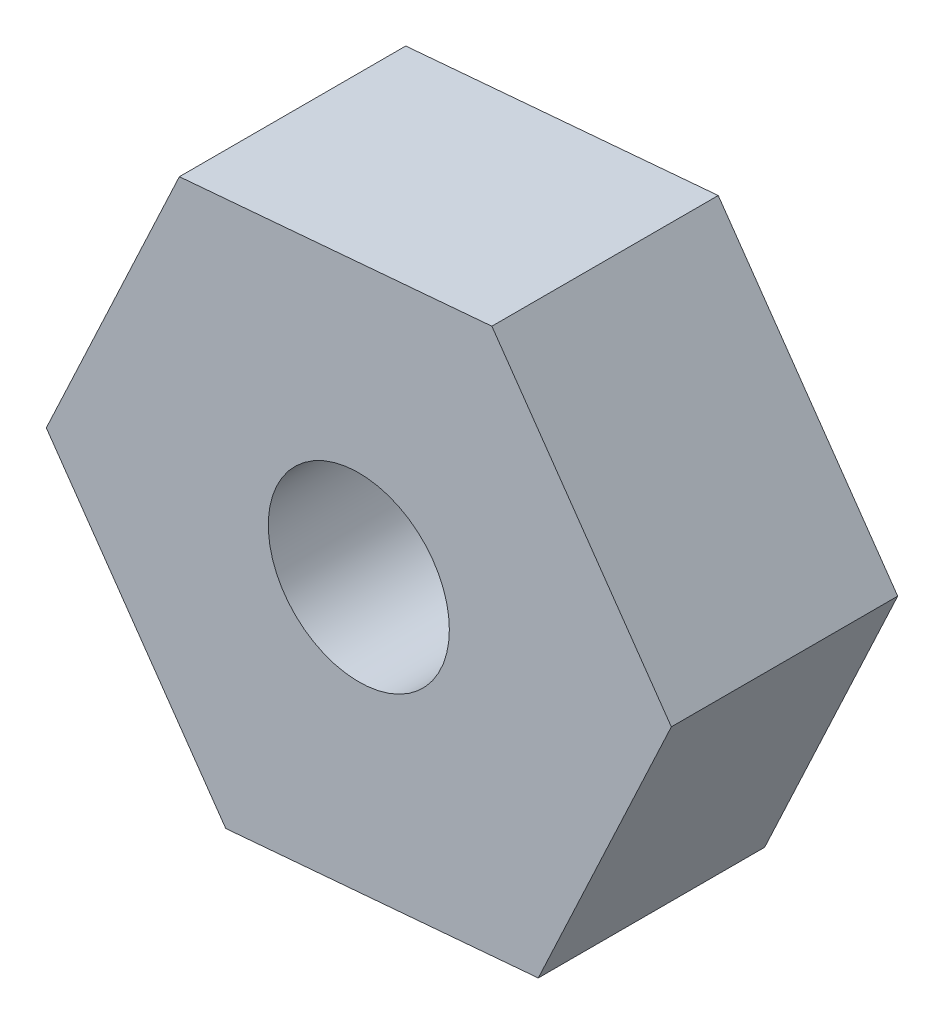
ISO-10303-21;
HEADER;
FILE_DESCRIPTION(('STEP AP214'),'2;1');
FILE_NAME('part.step','',(''),(''),'','','');
FILE_SCHEMA(('AUTOMOTIVE_DESIGN { 1 0 10303 214 1 1 1 1 }'));
ENDSEC;
DATA;
#1=APPLICATION_CONTEXT('core data for automotive mechanical design processes');
#2=APPLICATION_PROTOCOL_DEFINITION('international standard','automotive_design',2000,#1);
#3=PRODUCT_CONTEXT('',#1,'mechanical');
#4=PRODUCT('Part','Part','',(#3));
#5=PRODUCT_RELATED_PRODUCT_CATEGORY('part','',(#4));
#6=PRODUCT_DEFINITION_FORMATION('','',#4);
#7=PRODUCT_DEFINITION_CONTEXT('part definition',#1,'design');
#8=PRODUCT_DEFINITION('design','',#6,#7);
#9=PRODUCT_DEFINITION_SHAPE('','',#8);
#10=(LENGTH_UNIT() NAMED_UNIT(*) SI_UNIT(.MILLI.,.METRE.));
#11=(NAMED_UNIT(*) PLANE_ANGLE_UNIT() SI_UNIT($,.RADIAN.));
#12=(NAMED_UNIT(*) SI_UNIT($,.STERADIAN.) SOLID_ANGLE_UNIT());
#13=UNCERTAINTY_MEASURE_WITH_UNIT(LENGTH_MEASURE(1.E-05),#10,'distance_accuracy_value','');
#14=(GEOMETRIC_REPRESENTATION_CONTEXT(3) GLOBAL_UNCERTAINTY_ASSIGNED_CONTEXT((#13)) GLOBAL_UNIT_ASSIGNED_CONTEXT((#10,
#11,#12)) REPRESENTATION_CONTEXT('',''));
#15=CARTESIAN_POINT('',(0.,0.,0.));
#16=DIRECTION('',(0.,0.,1.));
#17=DIRECTION('',(1.,0.,0.));
#18=AXIS2_PLACEMENT_3D('',#15,#16,#17);
#19=CARTESIAN_POINT('',(0.,0.,6.35));
#20=DIRECTION('',(0.,0.,1.));
#21=DIRECTION('',(1.,0.,0.));
#22=AXIS2_PLACEMENT_3D('',#19,#20,#21);
#23=PLANE('',#22);
#24=DIRECTION('',(0.996346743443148,0.0854000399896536,0.));
#25=VECTOR('',#24,1.);
#26=CARTESIAN_POINT('',(-3.73258857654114,-7.96787189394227,6.35));
#27=LINE('',#26,#25);
#28=CARTESIAN_POINT('',(-3.73258857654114,-7.96787189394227,6.35));
#29=VERTEX_POINT('',#28);
#30=CARTESIAN_POINT('',(5.03408518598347,-7.21645247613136,6.35));
#31=VERTEX_POINT('',#30);
#32=EDGE_CURVE('E129',#29,#31,#27,.T.);
#33=ORIENTED_EDGE('',*,*,#32,.T.);
#34=DIRECTION('',(0.424214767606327,0.905561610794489,0.));
#35=VECTOR('',#34,1.);
#36=CARTESIAN_POINT('',(5.03408518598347,-7.21645247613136,6.35));
#37=LINE('',#36,#35);
#38=CARTESIAN_POINT('',(8.7666737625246,0.751419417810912,6.35));
#39=VERTEX_POINT('',#38);
#40=EDGE_CURVE('E87',#31,#39,#37,.T.);
#41=ORIENTED_EDGE('',*,*,#40,.T.);
#42=DIRECTION('',(-0.572131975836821,0.820161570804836,0.));
#43=VECTOR('',#42,1.);
#44=CARTESIAN_POINT('',(8.7666737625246,0.751419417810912,6.35));
#45=LINE('',#44,#43);
#46=CARTESIAN_POINT('',(3.73258857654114,7.96787189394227,6.35));
#47=VERTEX_POINT('',#46);
#48=EDGE_CURVE('E100',#39,#47,#45,.T.);
#49=ORIENTED_EDGE('',*,*,#48,.T.);
#50=DIRECTION('',(-0.996346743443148,-0.0854000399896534,0.));
#51=VECTOR('',#50,1.);
#52=CARTESIAN_POINT('',(3.73258857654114,7.96787189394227,6.35));
#53=LINE('',#52,#51);
#54=CARTESIAN_POINT('',(-5.03408518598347,7.21645247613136,6.35));
#55=VERTEX_POINT('',#54);
#56=EDGE_CURVE('E94',#47,#55,#53,.T.);
#57=ORIENTED_EDGE('',*,*,#56,.T.);
#58=DIRECTION('',(-0.424214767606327,-0.905561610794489,0.));
#59=VECTOR('',#58,1.);
#60=CARTESIAN_POINT('',(-5.03408518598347,7.21645247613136,6.35));
#61=LINE('',#60,#59);
#62=CARTESIAN_POINT('',(-8.7666737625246,-0.751419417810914,6.35));
#63=VERTEX_POINT('',#62);
#64=EDGE_CURVE('E98',#55,#63,#61,.T.);
#65=ORIENTED_EDGE('',*,*,#64,.T.);
#66=DIRECTION('',(0.572131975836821,-0.820161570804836,0.));
#67=VECTOR('',#66,1.);
#68=CARTESIAN_POINT('',(-8.7666737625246,-0.751419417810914,6.35));
#69=LINE('',#68,#67);
#70=EDGE_CURVE('E50',#63,#29,#69,.T.);
#71=ORIENTED_EDGE('',*,*,#70,.T.);
#72=EDGE_LOOP('',(#33,#41,#49,#57,#65,#71));
#73=FACE_BOUND('',#72,.T.);
#74=CARTESIAN_POINT('',(0.,0.,6.35));
#75=DIRECTION('',(0.,0.,1.));
#76=DIRECTION('',(1.,0.,0.));
#77=AXIS2_PLACEMENT_3D('',#74,#75,#76);
#78=CIRCLE('',#77,2.54);
#79=CARTESIAN_POINT('',(2.54,0.,6.35));
#80=VERTEX_POINT('',#79);
#81=EDGE_CURVE('E122',#80,#80,#78,.T.);
#82=ORIENTED_EDGE('',*,*,#81,.F.);
#83=EDGE_LOOP('',(#82));
#84=FACE_BOUND('',#83,.T.);
#85=ADVANCED_FACE('F33',(#73,#84),#23,.T.);
#86=CARTESIAN_POINT('',(0.,0.,0.));
#87=DIRECTION('',(0.,0.,1.));
#88=DIRECTION('',(1.,0.,0.));
#89=AXIS2_PLACEMENT_3D('',#86,#87,#88);
#90=PLANE('',#89);
#91=DIRECTION('',(0.996346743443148,0.0854000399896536,0.));
#92=VECTOR('',#91,1.);
#93=CARTESIAN_POINT('',(-3.73258857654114,-7.96787189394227,0.));
#94=LINE('',#93,#92);
#95=CARTESIAN_POINT('',(-3.73258857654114,-7.96787189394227,0.));
#96=VERTEX_POINT('',#95);
#97=CARTESIAN_POINT('',(5.03408518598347,-7.21645247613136,0.));
#98=VERTEX_POINT('',#97);
#99=EDGE_CURVE('E118',#96,#98,#94,.T.);
#100=ORIENTED_EDGE('',*,*,#99,.F.);
#101=DIRECTION('',(0.572131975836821,-0.820161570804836,0.));
#102=VECTOR('',#101,1.);
#103=CARTESIAN_POINT('',(-8.7666737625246,-0.751419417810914,0.));
#104=LINE('',#103,#102);
#105=CARTESIAN_POINT('',(-8.7666737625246,-0.751419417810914,0.));
#106=VERTEX_POINT('',#105);
#107=EDGE_CURVE('E79',#106,#96,#104,.T.);
#108=ORIENTED_EDGE('',*,*,#107,.F.);
#109=DIRECTION('',(-0.424214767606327,-0.905561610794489,0.));
#110=VECTOR('',#109,1.);
#111=CARTESIAN_POINT('',(-5.03408518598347,7.21645247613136,0.));
#112=LINE('',#111,#110);
#113=CARTESIAN_POINT('',(-5.03408518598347,7.21645247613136,0.));
#114=VERTEX_POINT('',#113);
#115=EDGE_CURVE('E73',#114,#106,#112,.T.);
#116=ORIENTED_EDGE('',*,*,#115,.F.);
#117=DIRECTION('',(-0.996346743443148,-0.0854000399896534,0.));
#118=VECTOR('',#117,1.);
#119=CARTESIAN_POINT('',(3.73258857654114,7.96787189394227,0.));
#120=LINE('',#119,#118);
#121=CARTESIAN_POINT('',(3.73258857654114,7.96787189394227,0.));
#122=VERTEX_POINT('',#121);
#123=EDGE_CURVE('E108',#122,#114,#120,.T.);
#124=ORIENTED_EDGE('',*,*,#123,.F.);
#125=DIRECTION('',(-0.572131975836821,0.820161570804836,0.));
#126=VECTOR('',#125,1.);
#127=CARTESIAN_POINT('',(8.7666737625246,0.751419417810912,0.));
#128=LINE('',#127,#126);
#129=CARTESIAN_POINT('',(8.7666737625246,0.751419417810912,0.));
#130=VERTEX_POINT('',#129);
#131=EDGE_CURVE('E124',#130,#122,#128,.T.);
#132=ORIENTED_EDGE('',*,*,#131,.F.);
#133=DIRECTION('',(0.424214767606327,0.905561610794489,0.));
#134=VECTOR('',#133,1.);
#135=CARTESIAN_POINT('',(5.03408518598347,-7.21645247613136,0.));
#136=LINE('',#135,#134);
#137=EDGE_CURVE('E121',#98,#130,#136,.T.);
#138=ORIENTED_EDGE('',*,*,#137,.F.);
#139=EDGE_LOOP('',(#100,#108,#116,#124,#132,#138));
#140=FACE_BOUND('',#139,.T.);
#141=CARTESIAN_POINT('',(0.,0.,0.));
#142=DIRECTION('',(0.,0.,1.));
#143=DIRECTION('',(1.,0.,0.));
#144=AXIS2_PLACEMENT_3D('',#141,#142,#143);
#145=CIRCLE('',#144,2.54);
#146=CARTESIAN_POINT('',(2.54,0.,0.));
#147=VERTEX_POINT('',#146);
#148=EDGE_CURVE('E222',#147,#147,#145,.T.);
#149=ORIENTED_EDGE('',*,*,#148,.T.);
#150=EDGE_LOOP('',(#149));
#151=FACE_BOUND('',#150,.T.);
#152=ADVANCED_FACE('F138',(#140,#151),#90,.F.);
#153=CARTESIAN_POINT('',(-3.73258857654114,-7.96787189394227,6.35));
#154=DIRECTION('',(-0.0854000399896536,0.996346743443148,0.));
#155=DIRECTION('',(-0.996346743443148,-0.0854000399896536,0.));
#156=AXIS2_PLACEMENT_3D('',#153,#154,#155);
#157=PLANE('',#156);
#158=ORIENTED_EDGE('',*,*,#99,.T.);
#159=DIRECTION('',(0.,0.,-1.));
#160=VECTOR('',#159,1.);
#161=CARTESIAN_POINT('',(5.03408518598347,-7.21645247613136,6.35));
#162=LINE('',#161,#160);
#163=EDGE_CURVE('E11',#31,#98,#162,.T.);
#164=ORIENTED_EDGE('',*,*,#163,.F.);
#165=ORIENTED_EDGE('',*,*,#32,.F.);
#166=DIRECTION('',(0.,0.,-1.));
#167=VECTOR('',#166,1.);
#168=CARTESIAN_POINT('',(-3.73258857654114,-7.96787189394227,6.35));
#169=LINE('',#168,#167);
#170=EDGE_CURVE('E114',#29,#96,#169,.T.);
#171=ORIENTED_EDGE('',*,*,#170,.T.);
#172=EDGE_LOOP('',(#158,#164,#165,#171));
#173=FACE_BOUND('',#172,.T.);
#174=ADVANCED_FACE('F35',(#173),#157,.F.);
#175=CARTESIAN_POINT('',(5.03408518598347,-7.21645247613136,6.35));
#176=DIRECTION('',(-0.905561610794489,0.424214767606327,0.));
#177=DIRECTION('',(-0.424214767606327,-0.905561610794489,0.));
#178=AXIS2_PLACEMENT_3D('',#175,#176,#177);
#179=PLANE('',#178);
#180=ORIENTED_EDGE('',*,*,#137,.T.);
#181=DIRECTION('',(0.,0.,-1.));
#182=VECTOR('',#181,1.);
#183=CARTESIAN_POINT('',(8.7666737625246,0.751419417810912,6.35));
#184=LINE('',#183,#182);
#185=EDGE_CURVE('E42',#39,#130,#184,.T.);
#186=ORIENTED_EDGE('',*,*,#185,.F.);
#187=ORIENTED_EDGE('',*,*,#40,.F.);
#188=ORIENTED_EDGE('',*,*,#163,.T.);
#189=EDGE_LOOP('',(#180,#186,#187,#188));
#190=FACE_BOUND('',#189,.T.);
#191=ADVANCED_FACE('F163',(#190),#179,.F.);
#192=CARTESIAN_POINT('',(8.7666737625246,0.751419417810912,6.35));
#193=DIRECTION('',(-0.820161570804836,-0.572131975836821,0.));
#194=DIRECTION('',(0.572131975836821,-0.820161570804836,0.));
#195=AXIS2_PLACEMENT_3D('',#192,#193,#194);
#196=PLANE('',#195);
#197=ORIENTED_EDGE('',*,*,#131,.T.);
#198=DIRECTION('',(0.,0.,-1.));
#199=VECTOR('',#198,1.);
#200=CARTESIAN_POINT('',(3.73258857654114,7.96787189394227,6.35));
#201=LINE('',#200,#199);
#202=EDGE_CURVE('E109',#47,#122,#201,.T.);
#203=ORIENTED_EDGE('',*,*,#202,.F.);
#204=ORIENTED_EDGE('',*,*,#48,.F.);
#205=ORIENTED_EDGE('',*,*,#185,.T.);
#206=EDGE_LOOP('',(#197,#203,#204,#205));
#207=FACE_BOUND('',#206,.T.);
#208=ADVANCED_FACE('F135',(#207),#196,.F.);
#209=CARTESIAN_POINT('',(3.73258857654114,7.96787189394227,6.35));
#210=DIRECTION('',(0.0854000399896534,-0.996346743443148,0.));
#211=DIRECTION('',(0.996346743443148,0.0854000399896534,0.));
#212=AXIS2_PLACEMENT_3D('',#209,#210,#211);
#213=PLANE('',#212);
#214=ORIENTED_EDGE('',*,*,#123,.T.);
#215=DIRECTION('',(0.,0.,-1.));
#216=VECTOR('',#215,1.);
#217=CARTESIAN_POINT('',(-5.03408518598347,7.21645247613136,6.35));
#218=LINE('',#217,#216);
#219=EDGE_CURVE('E105',#55,#114,#218,.T.);
#220=ORIENTED_EDGE('',*,*,#219,.F.);
#221=ORIENTED_EDGE('',*,*,#56,.F.);
#222=ORIENTED_EDGE('',*,*,#202,.T.);
#223=EDGE_LOOP('',(#214,#220,#221,#222));
#224=FACE_BOUND('',#223,.T.);
#225=ADVANCED_FACE('F106',(#224),#213,.F.);
#226=CARTESIAN_POINT('',(-5.03408518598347,7.21645247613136,6.35));
#227=DIRECTION('',(0.905561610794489,-0.424214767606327,0.));
#228=DIRECTION('',(0.424214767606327,0.905561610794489,0.));
#229=AXIS2_PLACEMENT_3D('',#226,#227,#228);
#230=PLANE('',#229);
#231=ORIENTED_EDGE('',*,*,#115,.T.);
#232=DIRECTION('',(0.,0.,-1.));
#233=VECTOR('',#232,1.);
#234=CARTESIAN_POINT('',(-8.7666737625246,-0.751419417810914,6.35));
#235=LINE('',#234,#233);
#236=EDGE_CURVE('E110',#63,#106,#235,.T.);
#237=ORIENTED_EDGE('',*,*,#236,.F.);
#238=ORIENTED_EDGE('',*,*,#64,.F.);
#239=ORIENTED_EDGE('',*,*,#219,.T.);
#240=EDGE_LOOP('',(#231,#237,#238,#239));
#241=FACE_BOUND('',#240,.T.);
#242=ADVANCED_FACE('F112',(#241),#230,.F.);
#243=CARTESIAN_POINT('',(-8.7666737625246,-0.751419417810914,6.35));
#244=DIRECTION('',(0.820161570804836,0.572131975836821,0.));
#245=DIRECTION('',(-0.572131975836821,0.820161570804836,0.));
#246=AXIS2_PLACEMENT_3D('',#243,#244,#245);
#247=PLANE('',#246);
#248=ORIENTED_EDGE('',*,*,#107,.T.);
#249=ORIENTED_EDGE('',*,*,#170,.F.);
#250=ORIENTED_EDGE('',*,*,#70,.F.);
#251=ORIENTED_EDGE('',*,*,#236,.T.);
#252=EDGE_LOOP('',(#248,#249,#250,#251));
#253=FACE_BOUND('',#252,.T.);
#254=ADVANCED_FACE('F143',(#253),#247,.F.);
#255=CARTESIAN_POINT('',(0.,0.,6.35));
#256=DIRECTION('',(0.,0.,-1.));
#257=DIRECTION('',(-1.,0.,0.));
#258=AXIS2_PLACEMENT_3D('',#255,#256,#257);
#259=CYLINDRICAL_SURFACE('',#258,2.54);
#260=ORIENTED_EDGE('',*,*,#81,.T.);
#261=EDGE_LOOP('',(#260));
#262=FACE_BOUND('',#261,.T.);
#263=ORIENTED_EDGE('',*,*,#148,.F.);
#264=EDGE_LOOP('',(#263));
#265=FACE_BOUND('',#264,.T.);
#266=ADVANCED_FACE('F145',(#262,#265),#259,.F.);
#267=CLOSED_SHELL('',(#85,#152,#174,#191,#208,#225,#242,#254,#266));
#268=MANIFOLD_SOLID_BREP('B2',#267);
#269=ADVANCED_BREP_SHAPE_REPRESENTATION('',(#18,#268),#14);
#270=SHAPE_DEFINITION_REPRESENTATION(#9,#269);
ENDSEC;
END-ISO-10303-21;
